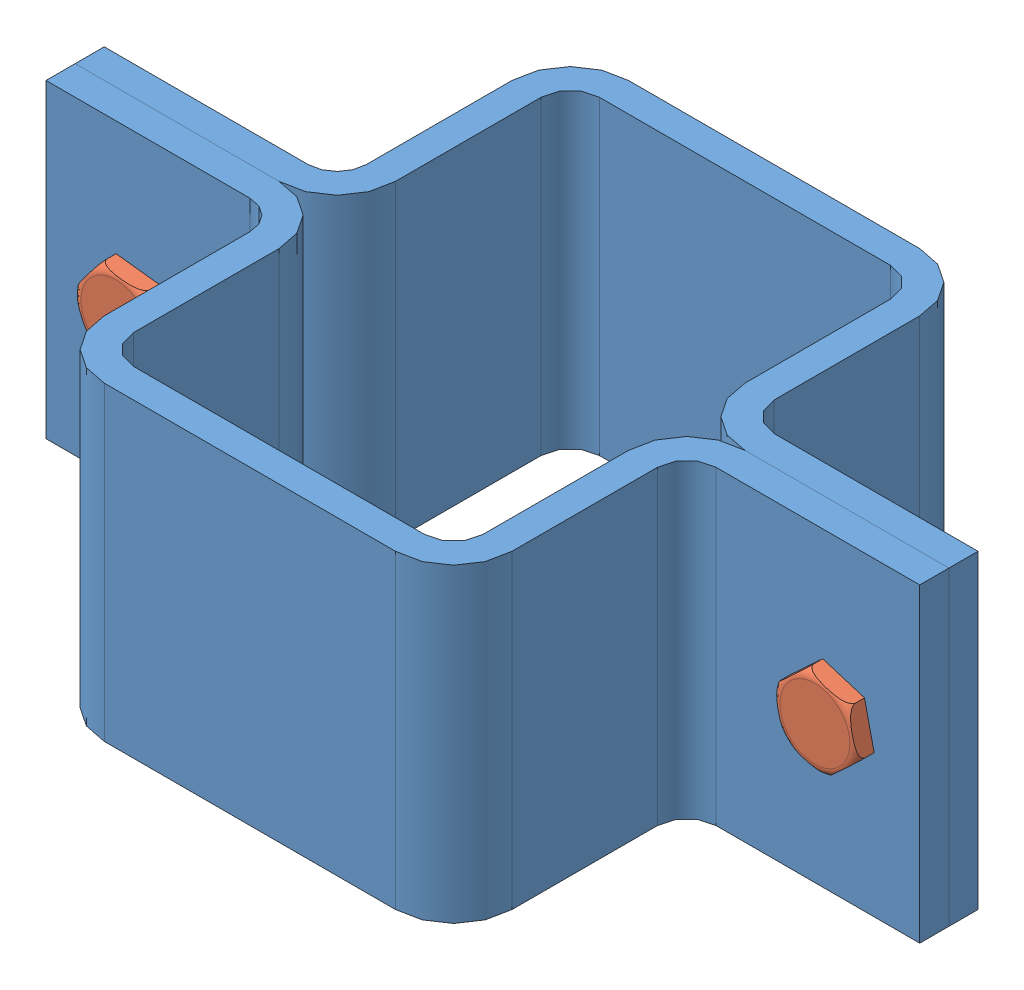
SolidWorks assembly component copied with mates.SLDASM, configuration Default (file format 7000). Lengths in mm.
Overall size (150 53.27 90).
4 component instances, 2 part files, 7 mates.
Components (placement in the parent):
- Mirrorsupport-1: Mirrorsupport.SLDPRT [Default] at (-62.632 48.4981 -22.3988) size (150 53.27 45)
- Mirrorsupport-2: Mirrorsupport.SLDPRT [Default] at (-62.632 48.4981 67.6012) x (1 0 0) z (0 0 -1) size (150 53.27 45)
- bolt-1: bolt.SLDPRT [Default] at (-122.632 48.4981 12.6012) x (0.801792 -0.597604 0) z (-0.597604 -0.801792 0) size (13.75 18.28 15.76)
- bolt-3: bolt.SLDPRT [Default] at (-2.632 48.4981 12.6012) x (0.296558 0.955015 0) z (0.955015 -0.296558 0) size (13.75 18.28 15.76)
Mates (geometry in assembly coordinates):
- Coincident1: coincident aligned: plane of Mirrorsupport-1 through (-22.632 75.1329 12.6012) normal (0 1 0); plane of Mirrorsupport-2 through (-22.632 75.1329 32.6012) normal (0 1 0)
- Concentric1: concentric anti-aligned: cylinder of Mirrorsupport-1 through (-2.632 48.4981 22.6012) axis (0 0 -1) radius 5; cylinder of Mirrorsupport-2 through (-2.632 48.4981 22.6012) axis (0 0 1) radius 5
- Coincident2: coincident anti-aligned: plane of Mirrorsupport-1 through (12.368 75.1329 22.6012) normal (0 0 1); plane of Mirrorsupport-2 through (12.368 21.8632 22.6012) normal (0 0 -1)
- Concentric2: concentric aligned: cylinder of Mirrorsupport-1 through (-122.632 48.4981 22.6012) axis (0 0 -1) radius 5; cylinder of bolt-1 through (-122.632 48.4981 27.6012) axis (0 0 -1) radius 5
- Concentric3: concentric anti-aligned: circle of Mirrorsupport-1; cylinder of bolt-3 through (-2.632 48.4981 -0.3848) axis (0 0 1) radius 5
- Coincident6: coincident anti-aligned: plane of Mirrorsupport-2 through (-137.632 21.8632 27.6012) normal (0 0 1); plane of bolt-1 through (-127.1174 42.4802 27.6012) normal (0 0 -1)
- Coincident7: coincident anti-aligned: plane of Mirrorsupport-2 through (12.368 21.8632 27.6012) normal (0 0 1); plane of bolt-3 through (4.5359 46.2722 27.6012) normal (0 0 -1)
